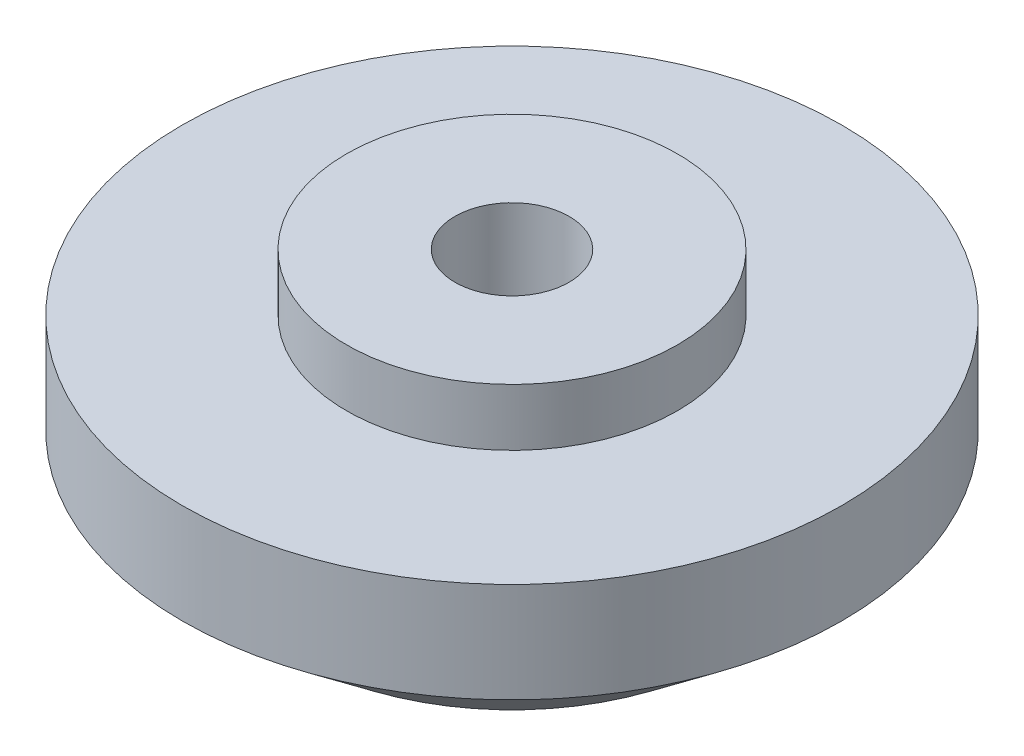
from build123d import *


with BuildPart() as part:
    # Esquisse1 → Base-R_volution (revolve)
    with BuildSketch(Plane.XY):
        Polygon((-98.5, 70), (-90.91, 70), (-90.91, 53), (-102.37397268, 53), (-110, 59), (-110, 66), (-98.5, 66), align=None)
    revolve(axis=Axis((-86.91, 100, 0), (0, -1, 0)))


solid = part.part
